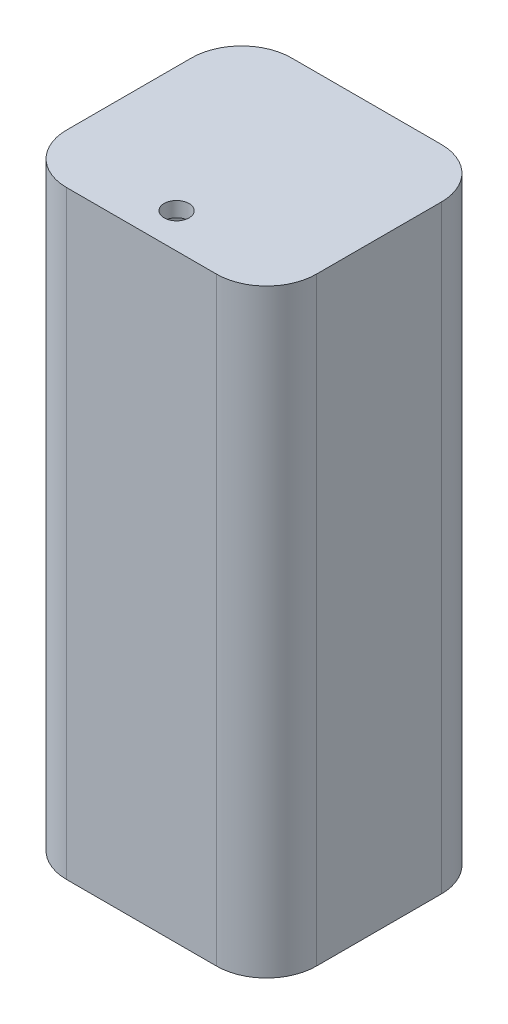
ISO-10303-21;
HEADER;
FILE_DESCRIPTION(('STEP AP214'),'2;1');
FILE_NAME('part.step','',(''),(''),'','','');
FILE_SCHEMA(('AUTOMOTIVE_DESIGN { 1 0 10303 214 1 1 1 1 }'));
ENDSEC;
DATA;
#1=APPLICATION_CONTEXT('core data for automotive mechanical design processes');
#2=APPLICATION_PROTOCOL_DEFINITION('international standard','automotive_design',2000,#1);
#3=PRODUCT_CONTEXT('',#1,'mechanical');
#4=PRODUCT('Part','Part','',(#3));
#5=PRODUCT_RELATED_PRODUCT_CATEGORY('part','',(#4));
#6=PRODUCT_DEFINITION_FORMATION('','',#4);
#7=PRODUCT_DEFINITION_CONTEXT('part definition',#1,'design');
#8=PRODUCT_DEFINITION('design','',#6,#7);
#9=PRODUCT_DEFINITION_SHAPE('','',#8);
#10=(LENGTH_UNIT() NAMED_UNIT(*) SI_UNIT(.MILLI.,.METRE.));
#11=(NAMED_UNIT(*) PLANE_ANGLE_UNIT() SI_UNIT($,.RADIAN.));
#12=(NAMED_UNIT(*) SI_UNIT($,.STERADIAN.) SOLID_ANGLE_UNIT());
#13=UNCERTAINTY_MEASURE_WITH_UNIT(LENGTH_MEASURE(1.E-05),#10,'distance_accuracy_value','');
#14=(GEOMETRIC_REPRESENTATION_CONTEXT(3) GLOBAL_UNCERTAINTY_ASSIGNED_CONTEXT((#13)) GLOBAL_UNIT_ASSIGNED_CONTEXT((#10,
#11,#12)) REPRESENTATION_CONTEXT('',''));
#15=CARTESIAN_POINT('',(0.,0.,0.));
#16=DIRECTION('',(0.,0.,1.));
#17=DIRECTION('',(1.,0.,0.));
#18=AXIS2_PLACEMENT_3D('',#15,#16,#17);
#19=CARTESIAN_POINT('',(15.,117.,-12.5));
#20=DIRECTION('',(0.,1.,0.));
#21=DIRECTION('',(0.,0.,1.));
#22=AXIS2_PLACEMENT_3D('',#19,#20,#21);
#23=PLANE('',#22);
#24=CARTESIAN_POINT('',(0.,117.,15.5));
#25=DIRECTION('',(0.,1.,0.));
#26=DIRECTION('',(0.,0.,1.));
#27=AXIS2_PLACEMENT_3D('',#24,#25,#26);
#28=CIRCLE('',#27,2.5);
#29=CARTESIAN_POINT('',(0.,117.,18.));
#30=VERTEX_POINT('',#29);
#31=EDGE_CURVE('E188',#30,#30,#28,.T.);
#32=ORIENTED_EDGE('',*,*,#31,.T.);
#33=EDGE_LOOP('',(#32));
#34=FACE_BOUND('',#33,.T.);
#35=DIRECTION('',(-1.,0.,0.));
#36=VECTOR('',#35,1.);
#37=CARTESIAN_POINT('',(-25.,117.,-19.5));
#38=LINE('',#37,#36);
#39=CARTESIAN_POINT('',(15.,117.,-19.5));
#40=VERTEX_POINT('',#39);
#41=CARTESIAN_POINT('',(-15.,117.,-19.5));
#42=VERTEX_POINT('',#41);
#43=EDGE_CURVE('E61',#40,#42,#38,.T.);
#44=ORIENTED_EDGE('',*,*,#43,.F.);
#45=CARTESIAN_POINT('',(15.,117.,-12.5));
#46=DIRECTION('',(0.,1.,0.));
#47=DIRECTION('',(0.,0.,1.));
#48=AXIS2_PLACEMENT_3D('',#45,#46,#47);
#49=CIRCLE('',#48,7.);
#50=CARTESIAN_POINT('',(22.,117.,-12.5));
#51=VERTEX_POINT('',#50);
#52=EDGE_CURVE('E202',#40,#51,#49,.F.);
#53=ORIENTED_EDGE('',*,*,#52,.T.);
#54=DIRECTION('',(0.,0.,-1.));
#55=VECTOR('',#54,1.);
#56=CARTESIAN_POINT('',(22.,117.,22.5));
#57=LINE('',#56,#55);
#58=CARTESIAN_POINT('',(22.,117.,12.5));
#59=VERTEX_POINT('',#58);
#60=EDGE_CURVE('E205',#59,#51,#57,.T.);
#61=ORIENTED_EDGE('',*,*,#60,.F.);
#62=CARTESIAN_POINT('',(15.,117.,12.5));
#63=DIRECTION('',(0.,1.,0.));
#64=DIRECTION('',(0.,0.,1.));
#65=AXIS2_PLACEMENT_3D('',#62,#63,#64);
#66=CIRCLE('',#65,7.);
#67=CARTESIAN_POINT('',(15.,117.,19.5));
#68=VERTEX_POINT('',#67);
#69=EDGE_CURVE('E179',#59,#68,#66,.F.);
#70=ORIENTED_EDGE('',*,*,#69,.T.);
#71=DIRECTION('',(1.,0.,0.));
#72=VECTOR('',#71,1.);
#73=CARTESIAN_POINT('',(-25.,117.,19.5));
#74=LINE('',#73,#72);
#75=CARTESIAN_POINT('',(-15.,117.,19.5));
#76=VERTEX_POINT('',#75);
#77=EDGE_CURVE('E177',#76,#68,#74,.T.);
#78=ORIENTED_EDGE('',*,*,#77,.F.);
#79=CARTESIAN_POINT('',(-15.,117.,12.5));
#80=DIRECTION('',(0.,1.,0.));
#81=DIRECTION('',(0.,0.,1.));
#82=AXIS2_PLACEMENT_3D('',#79,#80,#81);
#83=CIRCLE('',#82,7.);
#84=CARTESIAN_POINT('',(-22.,117.,12.5));
#85=VERTEX_POINT('',#84);
#86=EDGE_CURVE('E11',#76,#85,#83,.F.);
#87=ORIENTED_EDGE('',*,*,#86,.T.);
#88=DIRECTION('',(0.,0.,1.));
#89=VECTOR('',#88,1.);
#90=CARTESIAN_POINT('',(-22.,117.,22.5));
#91=LINE('',#90,#89);
#92=CARTESIAN_POINT('',(-22.,117.,-12.5));
#93=VERTEX_POINT('',#92);
#94=EDGE_CURVE('E172',#93,#85,#91,.T.);
#95=ORIENTED_EDGE('',*,*,#94,.F.);
#96=CARTESIAN_POINT('',(-15.,117.,-12.5));
#97=DIRECTION('',(0.,1.,0.));
#98=DIRECTION('',(0.,0.,1.));
#99=AXIS2_PLACEMENT_3D('',#96,#97,#98);
#100=CIRCLE('',#99,7.);
#101=EDGE_CURVE('E69',#93,#42,#100,.F.);
#102=ORIENTED_EDGE('',*,*,#101,.T.);
#103=EDGE_LOOP('',(#44,#53,#61,#70,#78,#87,#95,#102));
#104=FACE_BOUND('',#103,.T.);
#105=ADVANCED_FACE('F44',(#34,#104),#23,.F.);
#106=CARTESIAN_POINT('',(0.,3.,0.));
#107=DIRECTION('',(0.,-1.,0.));
#108=DIRECTION('',(0.,0.,-1.));
#109=AXIS2_PLACEMENT_3D('',#106,#107,#108);
#110=PLANE('',#109);
#111=CARTESIAN_POINT('',(0.,3.,15.5));
#112=DIRECTION('',(0.,-1.,0.));
#113=DIRECTION('',(0.,0.,-1.));
#114=AXIS2_PLACEMENT_3D('',#111,#112,#113);
#115=CIRCLE('',#114,2.5);
#116=CARTESIAN_POINT('',(0.,3.,13.));
#117=VERTEX_POINT('',#116);
#118=EDGE_CURVE('E47',#117,#117,#115,.T.);
#119=ORIENTED_EDGE('',*,*,#118,.T.);
#120=EDGE_LOOP('',(#119));
#121=FACE_BOUND('',#120,.T.);
#122=DIRECTION('',(0.,0.,1.));
#123=VECTOR('',#122,1.);
#124=CARTESIAN_POINT('',(-22.,3.,0.));
#125=LINE('',#124,#123);
#126=CARTESIAN_POINT('',(-22.,3.,-12.5));
#127=VERTEX_POINT('',#126);
#128=CARTESIAN_POINT('',(-22.,3.,12.5));
#129=VERTEX_POINT('',#128);
#130=EDGE_CURVE('E224',#127,#129,#125,.T.);
#131=ORIENTED_EDGE('',*,*,#130,.T.);
#132=CARTESIAN_POINT('',(-15.,3.,12.5));
#133=DIRECTION('',(0.,-1.,0.));
#134=DIRECTION('',(0.,0.,-1.));
#135=AXIS2_PLACEMENT_3D('',#132,#133,#134);
#136=CIRCLE('',#135,7.);
#137=CARTESIAN_POINT('',(-15.,3.,19.5));
#138=VERTEX_POINT('',#137);
#139=EDGE_CURVE('E167',#138,#129,#136,.T.);
#140=ORIENTED_EDGE('',*,*,#139,.F.);
#141=DIRECTION('',(1.,0.,0.));
#142=VECTOR('',#141,1.);
#143=CARTESIAN_POINT('',(0.,3.,19.5));
#144=LINE('',#143,#142);
#145=CARTESIAN_POINT('',(15.,3.,19.5));
#146=VERTEX_POINT('',#145);
#147=EDGE_CURVE('E171',#138,#146,#144,.T.);
#148=ORIENTED_EDGE('',*,*,#147,.T.);
#149=CARTESIAN_POINT('',(15.,3.,12.5));
#150=DIRECTION('',(0.,-1.,0.));
#151=DIRECTION('',(0.,0.,-1.));
#152=AXIS2_PLACEMENT_3D('',#149,#150,#151);
#153=CIRCLE('',#152,7.);
#154=CARTESIAN_POINT('',(22.,3.,12.5));
#155=VERTEX_POINT('',#154);
#156=EDGE_CURVE('E237',#155,#146,#153,.T.);
#157=ORIENTED_EDGE('',*,*,#156,.F.);
#158=DIRECTION('',(0.,0.,-1.));
#159=VECTOR('',#158,1.);
#160=CARTESIAN_POINT('',(22.,3.,0.));
#161=LINE('',#160,#159);
#162=CARTESIAN_POINT('',(22.,3.,-12.5));
#163=VERTEX_POINT('',#162);
#164=EDGE_CURVE('E207',#155,#163,#161,.T.);
#165=ORIENTED_EDGE('',*,*,#164,.T.);
#166=CARTESIAN_POINT('',(15.,3.,-12.5));
#167=DIRECTION('',(0.,-1.,0.));
#168=DIRECTION('',(0.,0.,-1.));
#169=AXIS2_PLACEMENT_3D('',#166,#167,#168);
#170=CIRCLE('',#169,7.);
#171=CARTESIAN_POINT('',(15.,3.,-19.5));
#172=VERTEX_POINT('',#171);
#173=EDGE_CURVE('E227',#172,#163,#170,.T.);
#174=ORIENTED_EDGE('',*,*,#173,.F.);
#175=DIRECTION('',(-1.,0.,0.));
#176=VECTOR('',#175,1.);
#177=CARTESIAN_POINT('',(0.,3.,-19.5));
#178=LINE('',#177,#176);
#179=CARTESIAN_POINT('',(-15.,3.,-19.5));
#180=VERTEX_POINT('',#179);
#181=EDGE_CURVE('E213',#172,#180,#178,.T.);
#182=ORIENTED_EDGE('',*,*,#181,.T.);
#183=CARTESIAN_POINT('',(-15.,3.,-12.5));
#184=DIRECTION('',(0.,-1.,0.));
#185=DIRECTION('',(0.,0.,-1.));
#186=AXIS2_PLACEMENT_3D('',#183,#184,#185);
#187=CIRCLE('',#186,7.);
#188=EDGE_CURVE('E229',#127,#180,#187,.T.);
#189=ORIENTED_EDGE('',*,*,#188,.F.);
#190=EDGE_LOOP('',(#131,#140,#148,#157,#165,#174,#182,#189));
#191=FACE_BOUND('',#190,.T.);
#192=ADVANCED_FACE('F386',(#121,#191),#110,.F.);
#193=CARTESIAN_POINT('',(15.,120.,12.5));
#194=DIRECTION('',(0.,-1.,0.));
#195=DIRECTION('',(0.,0.,-1.));
#196=AXIS2_PLACEMENT_3D('',#193,#194,#195);
#197=CYLINDRICAL_SURFACE('',#196,7.);
#198=ORIENTED_EDGE('',*,*,#69,.F.);
#199=DIRECTION('',(0.,1.,0.));
#200=VECTOR('',#199,1.);
#201=CARTESIAN_POINT('',(22.,120.,12.5));
#202=LINE('',#201,#200);
#203=EDGE_CURVE('E218',#59,#155,#202,.F.);
#204=ORIENTED_EDGE('',*,*,#203,.T.);
#205=ORIENTED_EDGE('',*,*,#156,.T.);
#206=DIRECTION('',(0.,1.,0.));
#207=VECTOR('',#206,1.);
#208=CARTESIAN_POINT('',(15.,120.,19.5));
#209=LINE('',#208,#207);
#210=EDGE_CURVE('E252',#146,#68,#209,.T.);
#211=ORIENTED_EDGE('',*,*,#210,.T.);
#212=EDGE_LOOP('',(#198,#204,#205,#211));
#213=FACE_BOUND('',#212,.T.);
#214=ADVANCED_FACE('F398',(#213),#197,.F.);
#215=CARTESIAN_POINT('',(-15.,120.,12.5));
#216=DIRECTION('',(0.,-1.,0.));
#217=DIRECTION('',(0.,0.,-1.));
#218=AXIS2_PLACEMENT_3D('',#215,#216,#217);
#219=CYLINDRICAL_SURFACE('',#218,7.);
#220=ORIENTED_EDGE('',*,*,#86,.F.);
#221=DIRECTION('',(0.,1.,0.));
#222=VECTOR('',#221,1.);
#223=CARTESIAN_POINT('',(-15.,120.,19.5));
#224=LINE('',#223,#222);
#225=EDGE_CURVE('E217',#76,#138,#224,.F.);
#226=ORIENTED_EDGE('',*,*,#225,.T.);
#227=ORIENTED_EDGE('',*,*,#139,.T.);
#228=DIRECTION('',(0.,1.,0.));
#229=VECTOR('',#228,1.);
#230=CARTESIAN_POINT('',(-22.,120.,12.5));
#231=LINE('',#230,#229);
#232=EDGE_CURVE('E161',#129,#85,#231,.T.);
#233=ORIENTED_EDGE('',*,*,#232,.T.);
#234=EDGE_LOOP('',(#220,#226,#227,#233));
#235=FACE_BOUND('',#234,.T.);
#236=ADVANCED_FACE('F162',(#235),#219,.F.);
#237=CARTESIAN_POINT('',(-25.,120.,19.5));
#238=DIRECTION('',(0.,0.,-1.));
#239=DIRECTION('',(-1.,0.,0.));
#240=AXIS2_PLACEMENT_3D('',#237,#238,#239);
#241=PLANE('',#240);
#242=ORIENTED_EDGE('',*,*,#225,.F.);
#243=ORIENTED_EDGE('',*,*,#77,.T.);
#244=ORIENTED_EDGE('',*,*,#210,.F.);
#245=ORIENTED_EDGE('',*,*,#147,.F.);
#246=EDGE_LOOP('',(#242,#243,#244,#245));
#247=FACE_BOUND('',#246,.T.);
#248=ADVANCED_FACE('F411',(#247),#241,.T.);
#249=CARTESIAN_POINT('',(-15.,120.,-12.5));
#250=DIRECTION('',(0.,-1.,0.));
#251=DIRECTION('',(0.,0.,-1.));
#252=AXIS2_PLACEMENT_3D('',#249,#250,#251);
#253=CYLINDRICAL_SURFACE('',#252,7.);
#254=ORIENTED_EDGE('',*,*,#101,.F.);
#255=DIRECTION('',(0.,1.,0.));
#256=VECTOR('',#255,1.);
#257=CARTESIAN_POINT('',(-22.,120.,-12.5));
#258=LINE('',#257,#256);
#259=EDGE_CURVE('E174',#93,#127,#258,.F.);
#260=ORIENTED_EDGE('',*,*,#259,.T.);
#261=ORIENTED_EDGE('',*,*,#188,.T.);
#262=DIRECTION('',(0.,1.,0.));
#263=VECTOR('',#262,1.);
#264=CARTESIAN_POINT('',(-15.,120.,-19.5));
#265=LINE('',#264,#263);
#266=EDGE_CURVE('E225',#180,#42,#265,.T.);
#267=ORIENTED_EDGE('',*,*,#266,.T.);
#268=EDGE_LOOP('',(#254,#260,#261,#267));
#269=FACE_BOUND('',#268,.T.);
#270=ADVANCED_FACE('F415',(#269),#253,.F.);
#271=CARTESIAN_POINT('',(-22.,120.,22.5));
#272=DIRECTION('',(1.,0.,0.));
#273=DIRECTION('',(0.,0.,-1.));
#274=AXIS2_PLACEMENT_3D('',#271,#272,#273);
#275=PLANE('',#274);
#276=ORIENTED_EDGE('',*,*,#259,.F.);
#277=ORIENTED_EDGE('',*,*,#94,.T.);
#278=ORIENTED_EDGE('',*,*,#232,.F.);
#279=ORIENTED_EDGE('',*,*,#130,.F.);
#280=EDGE_LOOP('',(#276,#277,#278,#279));
#281=FACE_BOUND('',#280,.T.);
#282=ADVANCED_FACE('F178',(#281),#275,.T.);
#283=CARTESIAN_POINT('',(15.,120.,-12.5));
#284=DIRECTION('',(0.,-1.,0.));
#285=DIRECTION('',(0.,0.,-1.));
#286=AXIS2_PLACEMENT_3D('',#283,#284,#285);
#287=CYLINDRICAL_SURFACE('',#286,7.);
#288=ORIENTED_EDGE('',*,*,#52,.F.);
#289=DIRECTION('',(0.,1.,0.));
#290=VECTOR('',#289,1.);
#291=CARTESIAN_POINT('',(15.,120.,-19.5));
#292=LINE('',#291,#290);
#293=EDGE_CURVE('E228',#40,#172,#292,.F.);
#294=ORIENTED_EDGE('',*,*,#293,.T.);
#295=ORIENTED_EDGE('',*,*,#173,.T.);
#296=DIRECTION('',(0.,1.,0.));
#297=VECTOR('',#296,1.);
#298=CARTESIAN_POINT('',(22.,120.,-12.5));
#299=LINE('',#298,#297);
#300=EDGE_CURVE('E212',#163,#51,#299,.T.);
#301=ORIENTED_EDGE('',*,*,#300,.T.);
#302=EDGE_LOOP('',(#288,#294,#295,#301));
#303=FACE_BOUND('',#302,.T.);
#304=ADVANCED_FACE('F408',(#303),#287,.F.);
#305=CARTESIAN_POINT('',(-25.,120.,-19.5));
#306=DIRECTION('',(0.,0.,1.));
#307=DIRECTION('',(1.,0.,0.));
#308=AXIS2_PLACEMENT_3D('',#305,#306,#307);
#309=PLANE('',#308);
#310=ORIENTED_EDGE('',*,*,#293,.F.);
#311=ORIENTED_EDGE('',*,*,#43,.T.);
#312=ORIENTED_EDGE('',*,*,#266,.F.);
#313=ORIENTED_EDGE('',*,*,#181,.F.);
#314=EDGE_LOOP('',(#310,#311,#312,#313));
#315=FACE_BOUND('',#314,.T.);
#316=ADVANCED_FACE('F403',(#315),#309,.T.);
#317=CARTESIAN_POINT('',(22.,120.,22.5));
#318=DIRECTION('',(-1.,0.,0.));
#319=DIRECTION('',(0.,0.,1.));
#320=AXIS2_PLACEMENT_3D('',#317,#318,#319);
#321=PLANE('',#320);
#322=ORIENTED_EDGE('',*,*,#203,.F.);
#323=ORIENTED_EDGE('',*,*,#60,.T.);
#324=ORIENTED_EDGE('',*,*,#300,.F.);
#325=ORIENTED_EDGE('',*,*,#164,.F.);
#326=EDGE_LOOP('',(#322,#323,#324,#325));
#327=FACE_BOUND('',#326,.T.);
#328=ADVANCED_FACE('F405',(#327),#321,.T.);
#329=CARTESIAN_POINT('',(0.,120.,15.5));
#330=DIRECTION('',(0.,-1.,0.));
#331=DIRECTION('',(0.,0.,-1.));
#332=AXIS2_PLACEMENT_3D('',#329,#330,#331);
#333=CYLINDRICAL_SURFACE('',#332,2.5);
#334=CARTESIAN_POINT('',(0.,0.,15.5));
#335=DIRECTION('',(0.,-1.,0.));
#336=DIRECTION('',(0.,0.,-1.));
#337=AXIS2_PLACEMENT_3D('',#334,#335,#336);
#338=CIRCLE('',#337,2.5);
#339=CARTESIAN_POINT('',(0.,0.,13.));
#340=VERTEX_POINT('',#339);
#341=EDGE_CURVE('E580',#340,#340,#338,.T.);
#342=ORIENTED_EDGE('',*,*,#341,.T.);
#343=EDGE_LOOP('',(#342));
#344=FACE_BOUND('',#343,.T.);
#345=ORIENTED_EDGE('',*,*,#118,.F.);
#346=EDGE_LOOP('',(#345));
#347=FACE_BOUND('',#346,.T.);
#348=ADVANCED_FACE('F404',(#344,#347),#333,.F.);
#349=CARTESIAN_POINT('',(0.,120.,15.5));
#350=DIRECTION('',(0.,-1.,0.));
#351=DIRECTION('',(0.,0.,-1.));
#352=AXIS2_PLACEMENT_3D('',#349,#350,#351);
#353=CIRCLE('',#352,2.5);
#354=CARTESIAN_POINT('',(0.,120.,13.));
#355=VERTEX_POINT('',#354);
#356=EDGE_CURVE('E573',#355,#355,#353,.T.);
#357=ORIENTED_EDGE('',*,*,#356,.F.);
#358=EDGE_LOOP('',(#357));
#359=FACE_BOUND('',#358,.T.);
#360=ORIENTED_EDGE('',*,*,#31,.F.);
#361=EDGE_LOOP('',(#360));
#362=FACE_BOUND('',#361,.T.);
#363=ADVANCED_FACE('F402',(#359,#362),#333,.F.);
#364=CARTESIAN_POINT('',(25.,120.,22.5));
#365=DIRECTION('',(-1.,0.,0.));
#366=DIRECTION('',(0.,0.,1.));
#367=AXIS2_PLACEMENT_3D('',#364,#365,#366);
#368=PLANE('',#367);
#369=DIRECTION('',(0.,-1.,0.));
#370=VECTOR('',#369,1.);
#371=CARTESIAN_POINT('',(25.,120.,12.5));
#372=LINE('',#371,#370);
#373=CARTESIAN_POINT('',(25.,120.,12.5));
#374=VERTEX_POINT('',#373);
#375=CARTESIAN_POINT('',(25.,0.,12.5));
#376=VERTEX_POINT('',#375);
#377=EDGE_CURVE('E323',#374,#376,#372,.T.);
#378=ORIENTED_EDGE('',*,*,#377,.T.);
#379=DIRECTION('',(0.,0.,-1.));
#380=VECTOR('',#379,1.);
#381=CARTESIAN_POINT('',(25.,0.,22.5));
#382=LINE('',#381,#380);
#383=CARTESIAN_POINT('',(25.,0.,-12.5));
#384=VERTEX_POINT('',#383);
#385=EDGE_CURVE('E254',#376,#384,#382,.T.);
#386=ORIENTED_EDGE('',*,*,#385,.T.);
#387=DIRECTION('',(0.,-1.,0.));
#388=VECTOR('',#387,1.);
#389=CARTESIAN_POINT('',(25.,120.,-12.5));
#390=LINE('',#389,#388);
#391=CARTESIAN_POINT('',(25.,120.,-12.5));
#392=VERTEX_POINT('',#391);
#393=EDGE_CURVE('E326',#384,#392,#390,.F.);
#394=ORIENTED_EDGE('',*,*,#393,.T.);
#395=DIRECTION('',(0.,0.,-1.));
#396=VECTOR('',#395,1.);
#397=CARTESIAN_POINT('',(25.,120.,22.5));
#398=LINE('',#397,#396);
#399=EDGE_CURVE('E258',#374,#392,#398,.T.);
#400=ORIENTED_EDGE('',*,*,#399,.F.);
#401=EDGE_LOOP('',(#378,#386,#394,#400));
#402=FACE_BOUND('',#401,.T.);
#403=ADVANCED_FACE('F348',(#402),#368,.F.);
#404=CARTESIAN_POINT('',(-25.,120.,-22.5));
#405=DIRECTION('',(0.,0.,1.));
#406=DIRECTION('',(1.,0.,0.));
#407=AXIS2_PLACEMENT_3D('',#404,#405,#406);
#408=PLANE('',#407);
#409=DIRECTION('',(0.,-1.,0.));
#410=VECTOR('',#409,1.);
#411=CARTESIAN_POINT('',(15.,120.,-22.5));
#412=LINE('',#411,#410);
#413=CARTESIAN_POINT('',(15.,120.,-22.5));
#414=VERTEX_POINT('',#413);
#415=CARTESIAN_POINT('',(15.,0.,-22.5));
#416=VERTEX_POINT('',#415);
#417=EDGE_CURVE('E302',#414,#416,#412,.T.);
#418=ORIENTED_EDGE('',*,*,#417,.T.);
#419=DIRECTION('',(-1.,0.,0.));
#420=VECTOR('',#419,1.);
#421=CARTESIAN_POINT('',(-25.,0.,-22.5));
#422=LINE('',#421,#420);
#423=CARTESIAN_POINT('',(-15.,0.,-22.5));
#424=VERTEX_POINT('',#423);
#425=EDGE_CURVE('E280',#416,#424,#422,.T.);
#426=ORIENTED_EDGE('',*,*,#425,.T.);
#427=DIRECTION('',(0.,-1.,0.));
#428=VECTOR('',#427,1.);
#429=CARTESIAN_POINT('',(-15.,120.,-22.5));
#430=LINE('',#429,#428);
#431=CARTESIAN_POINT('',(-15.,120.,-22.5));
#432=VERTEX_POINT('',#431);
#433=EDGE_CURVE('E306',#424,#432,#430,.F.);
#434=ORIENTED_EDGE('',*,*,#433,.T.);
#435=DIRECTION('',(-1.,0.,0.));
#436=VECTOR('',#435,1.);
#437=CARTESIAN_POINT('',(-25.,120.,-22.5));
#438=LINE('',#437,#436);
#439=EDGE_CURVE('E257',#414,#432,#438,.T.);
#440=ORIENTED_EDGE('',*,*,#439,.F.);
#441=EDGE_LOOP('',(#418,#426,#434,#440));
#442=FACE_BOUND('',#441,.T.);
#443=ADVANCED_FACE('F357',(#442),#408,.F.);
#444=CARTESIAN_POINT('',(-25.,120.,22.5));
#445=DIRECTION('',(1.,0.,0.));
#446=DIRECTION('',(0.,0.,-1.));
#447=AXIS2_PLACEMENT_3D('',#444,#445,#446);
#448=PLANE('',#447);
#449=DIRECTION('',(0.,-1.,0.));
#450=VECTOR('',#449,1.);
#451=CARTESIAN_POINT('',(-25.,120.,-12.5));
#452=LINE('',#451,#450);
#453=CARTESIAN_POINT('',(-25.,120.,-12.5));
#454=VERTEX_POINT('',#453);
#455=CARTESIAN_POINT('',(-25.,0.,-12.5));
#456=VERTEX_POINT('',#455);
#457=EDGE_CURVE('E287',#454,#456,#452,.T.);
#458=ORIENTED_EDGE('',*,*,#457,.T.);
#459=DIRECTION('',(0.,0.,1.));
#460=VECTOR('',#459,1.);
#461=CARTESIAN_POINT('',(-25.,0.,22.5));
#462=LINE('',#461,#460);
#463=CARTESIAN_POINT('',(-25.,0.,12.5));
#464=VERTEX_POINT('',#463);
#465=EDGE_CURVE('E284',#456,#464,#462,.T.);
#466=ORIENTED_EDGE('',*,*,#465,.T.);
#467=DIRECTION('',(0.,-1.,0.));
#468=VECTOR('',#467,1.);
#469=CARTESIAN_POINT('',(-25.,120.,12.5));
#470=LINE('',#469,#468);
#471=CARTESIAN_POINT('',(-25.,120.,12.5));
#472=VERTEX_POINT('',#471);
#473=EDGE_CURVE('E272',#464,#472,#470,.F.);
#474=ORIENTED_EDGE('',*,*,#473,.T.);
#475=DIRECTION('',(0.,0.,1.));
#476=VECTOR('',#475,1.);
#477=CARTESIAN_POINT('',(-25.,120.,22.5));
#478=LINE('',#477,#476);
#479=EDGE_CURVE('E264',#454,#472,#478,.T.);
#480=ORIENTED_EDGE('',*,*,#479,.F.);
#481=EDGE_LOOP('',(#458,#466,#474,#480));
#482=FACE_BOUND('',#481,.T.);
#483=ADVANCED_FACE('F367',(#482),#448,.F.);
#484=CARTESIAN_POINT('',(-25.,120.,22.5));
#485=DIRECTION('',(0.,0.,-1.));
#486=DIRECTION('',(-1.,0.,0.));
#487=AXIS2_PLACEMENT_3D('',#484,#485,#486);
#488=PLANE('',#487);
#489=DIRECTION('',(0.,-1.,0.));
#490=VECTOR('',#489,1.);
#491=CARTESIAN_POINT('',(-15.,120.,22.5));
#492=LINE('',#491,#490);
#493=CARTESIAN_POINT('',(-15.,120.,22.5));
#494=VERTEX_POINT('',#493);
#495=CARTESIAN_POINT('',(-15.,0.,22.5));
#496=VERTEX_POINT('',#495);
#497=EDGE_CURVE('E328',#494,#496,#492,.T.);
#498=ORIENTED_EDGE('',*,*,#497,.T.);
#499=DIRECTION('',(1.,0.,0.));
#500=VECTOR('',#499,1.);
#501=CARTESIAN_POINT('',(-25.,0.,22.5));
#502=LINE('',#501,#500);
#503=CARTESIAN_POINT('',(15.,0.,22.5));
#504=VERTEX_POINT('',#503);
#505=EDGE_CURVE('E261',#496,#504,#502,.T.);
#506=ORIENTED_EDGE('',*,*,#505,.T.);
#507=DIRECTION('',(0.,-1.,0.));
#508=VECTOR('',#507,1.);
#509=CARTESIAN_POINT('',(15.,120.,22.5));
#510=LINE('',#509,#508);
#511=CARTESIAN_POINT('',(15.,120.,22.5));
#512=VERTEX_POINT('',#511);
#513=EDGE_CURVE('E54',#504,#512,#510,.F.);
#514=ORIENTED_EDGE('',*,*,#513,.T.);
#515=DIRECTION('',(1.,0.,0.));
#516=VECTOR('',#515,1.);
#517=CARTESIAN_POINT('',(-25.,120.,22.5));
#518=LINE('',#517,#516);
#519=EDGE_CURVE('E267',#494,#512,#518,.T.);
#520=ORIENTED_EDGE('',*,*,#519,.F.);
#521=EDGE_LOOP('',(#498,#506,#514,#520));
#522=FACE_BOUND('',#521,.T.);
#523=ADVANCED_FACE('F339',(#522),#488,.F.);
#524=CARTESIAN_POINT('',(0.,120.,0.));
#525=DIRECTION('',(0.,-1.,0.));
#526=DIRECTION('',(0.,0.,-1.));
#527=AXIS2_PLACEMENT_3D('',#524,#525,#526);
#528=PLANE('',#527);
#529=ORIENTED_EDGE('',*,*,#356,.T.);
#530=EDGE_LOOP('',(#529));
#531=FACE_BOUND('',#530,.T.);
#532=ORIENTED_EDGE('',*,*,#439,.T.);
#533=CARTESIAN_POINT('',(-15.,120.,-12.5));
#534=DIRECTION('',(0.,-1.,0.));
#535=DIRECTION('',(0.,0.,-1.));
#536=AXIS2_PLACEMENT_3D('',#533,#534,#535);
#537=CIRCLE('',#536,10.);
#538=EDGE_CURVE('E319',#432,#454,#537,.F.);
#539=ORIENTED_EDGE('',*,*,#538,.T.);
#540=ORIENTED_EDGE('',*,*,#479,.T.);
#541=CARTESIAN_POINT('',(-15.,120.,12.5));
#542=DIRECTION('',(0.,-1.,0.));
#543=DIRECTION('',(0.,0.,-1.));
#544=AXIS2_PLACEMENT_3D('',#541,#542,#543);
#545=CIRCLE('',#544,10.);
#546=EDGE_CURVE('E313',#472,#494,#545,.F.);
#547=ORIENTED_EDGE('',*,*,#546,.T.);
#548=ORIENTED_EDGE('',*,*,#519,.T.);
#549=CARTESIAN_POINT('',(15.,120.,12.5));
#550=DIRECTION('',(0.,-1.,0.));
#551=DIRECTION('',(0.,0.,-1.));
#552=AXIS2_PLACEMENT_3D('',#549,#550,#551);
#553=CIRCLE('',#552,10.);
#554=EDGE_CURVE('E314',#512,#374,#553,.F.);
#555=ORIENTED_EDGE('',*,*,#554,.T.);
#556=ORIENTED_EDGE('',*,*,#399,.T.);
#557=CARTESIAN_POINT('',(15.,120.,-12.5));
#558=DIRECTION('',(0.,-1.,0.));
#559=DIRECTION('',(0.,0.,-1.));
#560=AXIS2_PLACEMENT_3D('',#557,#558,#559);
#561=CIRCLE('',#560,10.);
#562=EDGE_CURVE('E320',#392,#414,#561,.F.);
#563=ORIENTED_EDGE('',*,*,#562,.T.);
#564=EDGE_LOOP('',(#532,#539,#540,#547,#548,#555,#556,#563));
#565=FACE_BOUND('',#564,.T.);
#566=ADVANCED_FACE('F341',(#531,#565),#528,.F.);
#567=CARTESIAN_POINT('',(0.,0.,0.));
#568=DIRECTION('',(0.,-1.,0.));
#569=DIRECTION('',(0.,0.,-1.));
#570=AXIS2_PLACEMENT_3D('',#567,#568,#569);
#571=PLANE('',#570);
#572=ORIENTED_EDGE('',*,*,#341,.F.);
#573=EDGE_LOOP('',(#572));
#574=FACE_BOUND('',#573,.T.);
#575=ORIENTED_EDGE('',*,*,#465,.F.);
#576=CARTESIAN_POINT('',(-15.,0.,-12.5));
#577=DIRECTION('',(0.,-1.,0.));
#578=DIRECTION('',(0.,0.,-1.));
#579=AXIS2_PLACEMENT_3D('',#576,#577,#578);
#580=CIRCLE('',#579,10.);
#581=EDGE_CURVE('E305',#456,#424,#580,.T.);
#582=ORIENTED_EDGE('',*,*,#581,.T.);
#583=ORIENTED_EDGE('',*,*,#425,.F.);
#584=CARTESIAN_POINT('',(15.,0.,-12.5));
#585=DIRECTION('',(0.,-1.,0.));
#586=DIRECTION('',(0.,0.,-1.));
#587=AXIS2_PLACEMENT_3D('',#584,#585,#586);
#588=CIRCLE('',#587,10.);
#589=EDGE_CURVE('E298',#416,#384,#588,.T.);
#590=ORIENTED_EDGE('',*,*,#589,.T.);
#591=ORIENTED_EDGE('',*,*,#385,.F.);
#592=CARTESIAN_POINT('',(15.,0.,12.5));
#593=DIRECTION('',(0.,-1.,0.));
#594=DIRECTION('',(0.,0.,-1.));
#595=AXIS2_PLACEMENT_3D('',#592,#593,#594);
#596=CIRCLE('',#595,10.);
#597=EDGE_CURVE('E299',#376,#504,#596,.T.);
#598=ORIENTED_EDGE('',*,*,#597,.T.);
#599=ORIENTED_EDGE('',*,*,#505,.F.);
#600=CARTESIAN_POINT('',(-15.,0.,12.5));
#601=DIRECTION('',(0.,-1.,0.));
#602=DIRECTION('',(0.,0.,-1.));
#603=AXIS2_PLACEMENT_3D('',#600,#601,#602);
#604=CIRCLE('',#603,10.);
#605=EDGE_CURVE('E291',#496,#464,#604,.T.);
#606=ORIENTED_EDGE('',*,*,#605,.T.);
#607=EDGE_LOOP('',(#575,#582,#583,#590,#591,#598,#599,#606));
#608=FACE_BOUND('',#607,.T.);
#609=ADVANCED_FACE('F374',(#574,#608),#571,.T.);
#610=CARTESIAN_POINT('',(-15.,120.,-12.5));
#611=DIRECTION('',(0.,-1.,0.));
#612=DIRECTION('',(0.,0.,-1.));
#613=AXIS2_PLACEMENT_3D('',#610,#611,#612);
#614=CYLINDRICAL_SURFACE('',#613,10.);
#615=ORIENTED_EDGE('',*,*,#581,.F.);
#616=ORIENTED_EDGE('',*,*,#457,.F.);
#617=ORIENTED_EDGE('',*,*,#538,.F.);
#618=ORIENTED_EDGE('',*,*,#433,.F.);
#619=EDGE_LOOP('',(#615,#616,#617,#618));
#620=FACE_BOUND('',#619,.T.);
#621=ADVANCED_FACE('F370',(#620),#614,.T.);
#622=CARTESIAN_POINT('',(15.,120.,-12.5));
#623=DIRECTION('',(0.,-1.,0.));
#624=DIRECTION('',(0.,0.,-1.));
#625=AXIS2_PLACEMENT_3D('',#622,#623,#624);
#626=CYLINDRICAL_SURFACE('',#625,10.);
#627=ORIENTED_EDGE('',*,*,#589,.F.);
#628=ORIENTED_EDGE('',*,*,#417,.F.);
#629=ORIENTED_EDGE('',*,*,#562,.F.);
#630=ORIENTED_EDGE('',*,*,#393,.F.);
#631=EDGE_LOOP('',(#627,#628,#629,#630));
#632=FACE_BOUND('',#631,.T.);
#633=ADVANCED_FACE('F360',(#632),#626,.T.);
#634=CARTESIAN_POINT('',(15.,120.,12.5));
#635=DIRECTION('',(0.,-1.,0.));
#636=DIRECTION('',(0.,0.,-1.));
#637=AXIS2_PLACEMENT_3D('',#634,#635,#636);
#638=CYLINDRICAL_SURFACE('',#637,10.);
#639=ORIENTED_EDGE('',*,*,#597,.F.);
#640=ORIENTED_EDGE('',*,*,#377,.F.);
#641=ORIENTED_EDGE('',*,*,#554,.F.);
#642=ORIENTED_EDGE('',*,*,#513,.F.);
#643=EDGE_LOOP('',(#639,#640,#641,#642));
#644=FACE_BOUND('',#643,.T.);
#645=ADVANCED_FACE('F350',(#644),#638,.T.);
#646=CARTESIAN_POINT('',(-15.,120.,12.5));
#647=DIRECTION('',(0.,-1.,0.));
#648=DIRECTION('',(0.,0.,-1.));
#649=AXIS2_PLACEMENT_3D('',#646,#647,#648);
#650=CYLINDRICAL_SURFACE('',#649,10.);
#651=ORIENTED_EDGE('',*,*,#605,.F.);
#652=ORIENTED_EDGE('',*,*,#497,.F.);
#653=ORIENTED_EDGE('',*,*,#546,.F.);
#654=ORIENTED_EDGE('',*,*,#473,.F.);
#655=EDGE_LOOP('',(#651,#652,#653,#654));
#656=FACE_BOUND('',#655,.T.);
#657=ADVANCED_FACE('F50',(#656),#650,.T.);
#658=CLOSED_SHELL('',(#105,#192,#214,#236,#248,#270,#282,#304,#316,#328,#348,#363,#403,#443,
#483,#523,#566,#609,#621,#633,#645,#657));
#659=MANIFOLD_SOLID_BREP('B2',#658);
#660=ADVANCED_BREP_SHAPE_REPRESENTATION('',(#18,#659),#14);
#661=SHAPE_DEFINITION_REPRESENTATION(#9,#660);
ENDSEC;
END-ISO-10303-21;
